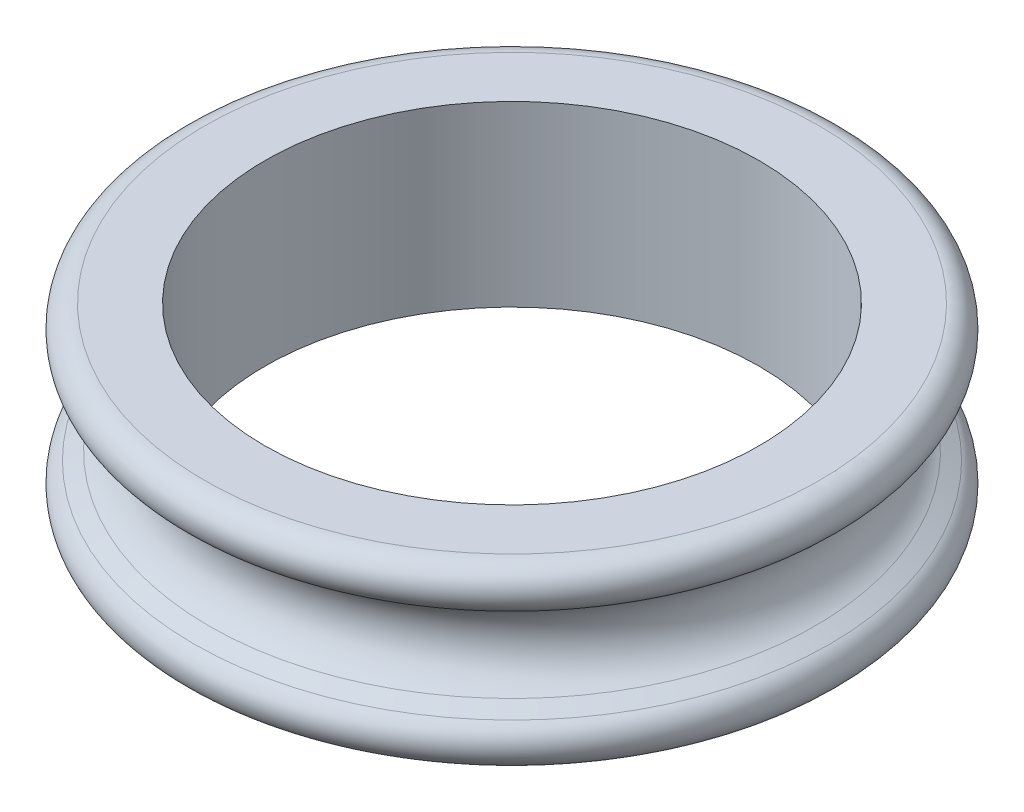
ISO-10303-21;
HEADER;
FILE_DESCRIPTION(('STEP AP214'),'2;1');
FILE_NAME('part.step','',(''),(''),'','','');
FILE_SCHEMA(('AUTOMOTIVE_DESIGN { 1 0 10303 214 1 1 1 1 }'));
ENDSEC;
DATA;
#1=APPLICATION_CONTEXT('core data for automotive mechanical design processes');
#2=APPLICATION_PROTOCOL_DEFINITION('international standard','automotive_design',2000,#1);
#3=PRODUCT_CONTEXT('',#1,'mechanical');
#4=PRODUCT('Part','Part','',(#3));
#5=PRODUCT_RELATED_PRODUCT_CATEGORY('part','',(#4));
#6=PRODUCT_DEFINITION_FORMATION('','',#4);
#7=PRODUCT_DEFINITION_CONTEXT('part definition',#1,'design');
#8=PRODUCT_DEFINITION('design','',#6,#7);
#9=PRODUCT_DEFINITION_SHAPE('','',#8);
#10=(LENGTH_UNIT() NAMED_UNIT(*) SI_UNIT(.MILLI.,.METRE.));
#11=(NAMED_UNIT(*) PLANE_ANGLE_UNIT() SI_UNIT($,.RADIAN.));
#12=(NAMED_UNIT(*) SI_UNIT($,.STERADIAN.) SOLID_ANGLE_UNIT());
#13=UNCERTAINTY_MEASURE_WITH_UNIT(LENGTH_MEASURE(1.E-05),#10,'distance_accuracy_value','');
#14=(GEOMETRIC_REPRESENTATION_CONTEXT(3) GLOBAL_UNCERTAINTY_ASSIGNED_CONTEXT((#13)) GLOBAL_UNIT_ASSIGNED_CONTEXT((#10,
#11,#12)) REPRESENTATION_CONTEXT('',''));
#15=CARTESIAN_POINT('',(0.,0.,0.));
#16=DIRECTION('',(0.,0.,1.));
#17=DIRECTION('',(1.,0.,0.));
#18=AXIS2_PLACEMENT_3D('',#15,#16,#17);
#19=CARTESIAN_POINT('',(0.,8.,0.));
#20=DIRECTION('',(0.,1.,0.));
#21=DIRECTION('',(0.,0.,1.));
#22=AXIS2_PLACEMENT_3D('',#19,#20,#21);
#23=PLANE('',#22);
#24=CARTESIAN_POINT('',(0.,8.,0.));
#25=DIRECTION('',(0.,1.,0.));
#26=DIRECTION('',(0.,0.,1.));
#27=AXIS2_PLACEMENT_3D('',#24,#25,#26);
#28=CIRCLE('',#27,11.1);
#29=CARTESIAN_POINT('',(0.,8.,11.1));
#30=VERTEX_POINT('',#29);
#31=EDGE_CURVE('E10',#30,#30,#28,.T.);
#32=ORIENTED_EDGE('',*,*,#31,.F.);
#33=EDGE_LOOP('',(#32));
#34=FACE_BOUND('',#33,.T.);
#35=CARTESIAN_POINT('',(0.,8.,0.));
#36=DIRECTION('',(0.,-1.,0.));
#37=DIRECTION('',(0.,0.,-1.));
#38=AXIS2_PLACEMENT_3D('',#35,#36,#37);
#39=CIRCLE('',#38,13.8012111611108);
#40=CARTESIAN_POINT('',(0.,8.,-13.8012111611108));
#41=VERTEX_POINT('',#40);
#42=EDGE_CURVE('E58',#41,#41,#39,.T.);
#43=ORIENTED_EDGE('',*,*,#42,.F.);
#44=EDGE_LOOP('',(#43));
#45=FACE_BOUND('',#44,.T.);
#46=ADVANCED_FACE('F31',(#34,#45),#23,.T.);
#47=CARTESIAN_POINT('',(0.,0.,0.));
#48=DIRECTION('',(0.,1.,0.));
#49=DIRECTION('',(0.,0.,1.));
#50=AXIS2_PLACEMENT_3D('',#47,#48,#49);
#51=PLANE('',#50);
#52=CARTESIAN_POINT('',(0.,0.,0.));
#53=DIRECTION('',(0.,1.,0.));
#54=DIRECTION('',(0.,0.,1.));
#55=AXIS2_PLACEMENT_3D('',#52,#53,#54);
#56=CIRCLE('',#55,11.1);
#57=CARTESIAN_POINT('',(0.,0.,11.1));
#58=VERTEX_POINT('',#57);
#59=EDGE_CURVE('E35',#58,#58,#56,.T.);
#60=ORIENTED_EDGE('',*,*,#59,.T.);
#61=EDGE_LOOP('',(#60));
#62=FACE_BOUND('',#61,.T.);
#63=CARTESIAN_POINT('',(0.,0.,0.));
#64=DIRECTION('',(0.,-1.,0.));
#65=DIRECTION('',(0.,0.,-1.));
#66=AXIS2_PLACEMENT_3D('',#63,#64,#65);
#67=CIRCLE('',#66,13.8012111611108);
#68=CARTESIAN_POINT('',(0.,0.,-13.8012111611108));
#69=VERTEX_POINT('',#68);
#70=EDGE_CURVE('E42',#69,#69,#67,.T.);
#71=ORIENTED_EDGE('',*,*,#70,.T.);
#72=EDGE_LOOP('',(#71));
#73=FACE_BOUND('',#72,.T.);
#74=ADVANCED_FACE('F33',(#62,#73),#51,.F.);
#75=CARTESIAN_POINT('',(0.,8.,0.));
#76=DIRECTION('',(0.,-1.,0.));
#77=DIRECTION('',(0.,0.,-1.));
#78=AXIS2_PLACEMENT_3D('',#75,#76,#77);
#79=CYLINDRICAL_SURFACE('',#78,11.1);
#80=ORIENTED_EDGE('',*,*,#31,.T.);
#81=EDGE_LOOP('',(#80));
#82=FACE_BOUND('',#81,.T.);
#83=ORIENTED_EDGE('',*,*,#59,.F.);
#84=EDGE_LOOP('',(#83));
#85=FACE_BOUND('',#84,.T.);
#86=ADVANCED_FACE('F70',(#82,#85),#79,.F.);
#87=CARTESIAN_POINT('',(0.,1.,0.));
#88=DIRECTION('',(0.,-1.,0.));
#89=DIRECTION('',(0.,0.,-1.));
#90=AXIS2_PLACEMENT_3D('',#87,#88,#89);
#91=TOROIDAL_SURFACE('',#90,13.8012111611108,1.);
#92=CARTESIAN_POINT('',(0.,1.87799170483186,0.));
#93=DIRECTION('',(0.,-1.,0.));
#94=DIRECTION('',(0.,0.,-1.));
#95=AXIS2_PLACEMENT_3D('',#92,#93,#94);
#96=CIRCLE('',#95,14.2798870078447);
#97=CARTESIAN_POINT('',(0.,1.87799170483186,-14.2798870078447));
#98=VERTEX_POINT('',#97);
#99=EDGE_CURVE('E46',#98,#98,#96,.T.);
#100=ORIENTED_EDGE('',*,*,#99,.T.);
#101=EDGE_LOOP('',(#100));
#102=FACE_BOUND('',#101,.T.);
#103=ORIENTED_EDGE('',*,*,#70,.F.);
#104=EDGE_LOOP('',(#103));
#105=FACE_BOUND('',#104,.T.);
#106=ADVANCED_FACE('F75',(#102,#105),#91,.T.);
#107=CARTESIAN_POINT('',(0.,1.87799170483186,0.));
#108=DIRECTION('',(0.,-1.,0.));
#109=DIRECTION('',(0.,0.,-1.));
#110=AXIS2_PLACEMENT_3D('',#107,#108,#109);
#111=CONICAL_SURFACE('',#110,14.2798870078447,1.07165039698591);
#112=CARTESIAN_POINT('',(0.,2.24401659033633,0.));
#113=DIRECTION('',(0.,-1.,0.));
#114=DIRECTION('',(0.,0.,-1.));
#115=AXIS2_PLACEMENT_3D('',#112,#113,#114);
#116=CIRCLE('',#115,13.6085207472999);
#117=CARTESIAN_POINT('',(0.,2.24401659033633,-13.6085207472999));
#118=VERTEX_POINT('',#117);
#119=EDGE_CURVE('E49',#118,#118,#116,.T.);
#120=ORIENTED_EDGE('',*,*,#119,.T.);
#121=EDGE_LOOP('',(#120));
#122=FACE_BOUND('',#121,.T.);
#123=ORIENTED_EDGE('',*,*,#99,.F.);
#124=EDGE_LOOP('',(#123));
#125=FACE_BOUND('',#124,.T.);
#126=ADVANCED_FACE('F78',(#122,#125),#111,.T.);
#127=CARTESIAN_POINT('',(0.,4.,0.));
#128=DIRECTION('',(0.,-1.,0.));
#129=DIRECTION('',(0.,0.,-1.));
#130=AXIS2_PLACEMENT_3D('',#127,#128,#129);
#131=TOROIDAL_SURFACE('',#130,14.5658724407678,1.99999999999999);
#132=CARTESIAN_POINT('',(0.,5.75598340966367,0.));
#133=DIRECTION('',(0.,-1.,0.));
#134=DIRECTION('',(0.,0.,-1.));
#135=AXIS2_PLACEMENT_3D('',#132,#133,#134);
#136=CIRCLE('',#135,13.6085207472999);
#137=CARTESIAN_POINT('',(0.,5.75598340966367,-13.6085207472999));
#138=VERTEX_POINT('',#137);
#139=EDGE_CURVE('E52',#138,#138,#136,.T.);
#140=ORIENTED_EDGE('',*,*,#139,.T.);
#141=EDGE_LOOP('',(#140));
#142=FACE_BOUND('',#141,.T.);
#143=ORIENTED_EDGE('',*,*,#119,.F.);
#144=EDGE_LOOP('',(#143));
#145=FACE_BOUND('',#144,.T.);
#146=ADVANCED_FACE('F82',(#142,#145),#131,.F.);
#147=CARTESIAN_POINT('',(0.,5.75598340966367,0.));
#148=DIRECTION('',(0.,1.,0.));
#149=DIRECTION('',(0.,0.,1.));
#150=AXIS2_PLACEMENT_3D('',#147,#148,#149);
#151=CONICAL_SURFACE('',#150,13.6085207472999,1.07165039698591);
#152=CARTESIAN_POINT('',(0.,6.12200829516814,0.));
#153=DIRECTION('',(0.,-1.,0.));
#154=DIRECTION('',(0.,0.,-1.));
#155=AXIS2_PLACEMENT_3D('',#152,#153,#154);
#156=CIRCLE('',#155,14.2798870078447);
#157=CARTESIAN_POINT('',(0.,6.12200829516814,-14.2798870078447));
#158=VERTEX_POINT('',#157);
#159=EDGE_CURVE('E55',#158,#158,#156,.T.);
#160=ORIENTED_EDGE('',*,*,#159,.T.);
#161=EDGE_LOOP('',(#160));
#162=FACE_BOUND('',#161,.T.);
#163=ORIENTED_EDGE('',*,*,#139,.F.);
#164=EDGE_LOOP('',(#163));
#165=FACE_BOUND('',#164,.T.);
#166=ADVANCED_FACE('F86',(#162,#165),#151,.T.);
#167=CARTESIAN_POINT('',(0.,7.,0.));
#168=DIRECTION('',(0.,-1.,0.));
#169=DIRECTION('',(0.,0.,-1.));
#170=AXIS2_PLACEMENT_3D('',#167,#168,#169);
#171=TOROIDAL_SURFACE('',#170,13.8012111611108,1.);
#172=ORIENTED_EDGE('',*,*,#42,.T.);
#173=EDGE_LOOP('',(#172));
#174=FACE_BOUND('',#173,.T.);
#175=ORIENTED_EDGE('',*,*,#159,.F.);
#176=EDGE_LOOP('',(#175));
#177=FACE_BOUND('',#176,.T.);
#178=ADVANCED_FACE('F62',(#174,#177),#171,.T.);
#179=CLOSED_SHELL('',(#46,#74,#86,#106,#126,#146,#166,#178));
#180=MANIFOLD_SOLID_BREP('B2',#179);
#181=ADVANCED_BREP_SHAPE_REPRESENTATION('',(#18,#180),#14);
#182=SHAPE_DEFINITION_REPRESENTATION(#9,#181);
ENDSEC;
END-ISO-10303-21;
